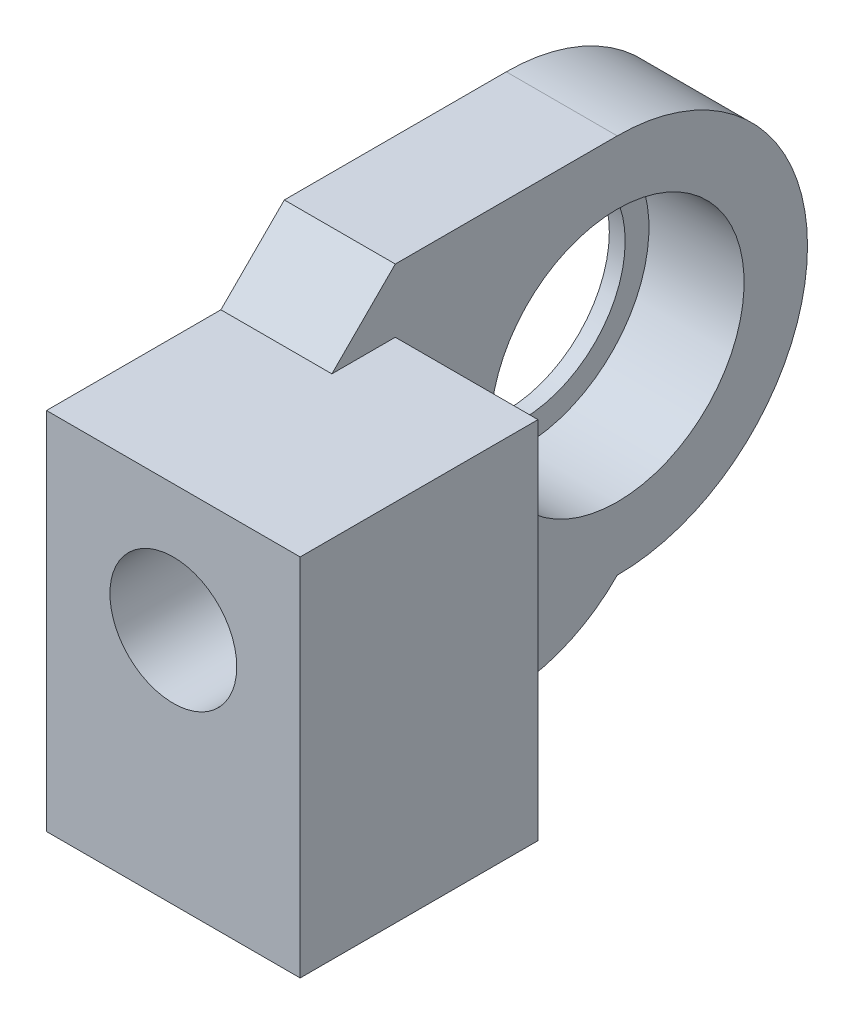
ISO-10303-21;
HEADER;
FILE_DESCRIPTION(('STEP AP214'),'2;1');
FILE_NAME('part.step','',(''),(''),'','','');
FILE_SCHEMA(('AUTOMOTIVE_DESIGN { 1 0 10303 214 1 1 1 1 }'));
ENDSEC;
DATA;
#1=APPLICATION_CONTEXT('core data for automotive mechanical design processes');
#2=APPLICATION_PROTOCOL_DEFINITION('international standard','automotive_design',2000,#1);
#3=PRODUCT_CONTEXT('',#1,'mechanical');
#4=PRODUCT('Part','Part','',(#3));
#5=PRODUCT_RELATED_PRODUCT_CATEGORY('part','',(#4));
#6=PRODUCT_DEFINITION_FORMATION('','',#4);
#7=PRODUCT_DEFINITION_CONTEXT('part definition',#1,'design');
#8=PRODUCT_DEFINITION('design','',#6,#7);
#9=PRODUCT_DEFINITION_SHAPE('','',#8);
#10=(LENGTH_UNIT() NAMED_UNIT(*) SI_UNIT(.MILLI.,.METRE.));
#11=(NAMED_UNIT(*) PLANE_ANGLE_UNIT() SI_UNIT($,.RADIAN.));
#12=(NAMED_UNIT(*) SI_UNIT($,.STERADIAN.) SOLID_ANGLE_UNIT());
#13=UNCERTAINTY_MEASURE_WITH_UNIT(LENGTH_MEASURE(1.E-05),#10,'distance_accuracy_value','');
#14=(GEOMETRIC_REPRESENTATION_CONTEXT(3) GLOBAL_UNCERTAINTY_ASSIGNED_CONTEXT((#13)) GLOBAL_UNIT_ASSIGNED_CONTEXT((#10,
#11,#12)) REPRESENTATION_CONTEXT('',''));
#15=CARTESIAN_POINT('',(0.,0.,0.));
#16=DIRECTION('',(0.,0.,1.));
#17=DIRECTION('',(1.,0.,0.));
#18=AXIS2_PLACEMENT_3D('',#15,#16,#17);
#19=CARTESIAN_POINT('',(0.,0.,10.));
#20=DIRECTION('',(0.,0.,-1.));
#21=DIRECTION('',(-1.,0.,0.));
#22=AXIS2_PLACEMENT_3D('',#19,#20,#21);
#23=PLANE('',#22);
#24=DIRECTION('',(0.,1.,0.));
#25=VECTOR('',#24,1.);
#26=CARTESIAN_POINT('',(8.,8.,10.));
#27=LINE('',#26,#25);
#28=CARTESIAN_POINT('',(8.,-15.,10.));
#29=VERTEX_POINT('',#28);
#30=CARTESIAN_POINT('',(8.,8.,10.));
#31=VERTEX_POINT('',#30);
#32=EDGE_CURVE('E163',#29,#31,#27,.T.);
#33=ORIENTED_EDGE('',*,*,#32,.T.);
#34=DIRECTION('',(-1.,0.,0.));
#35=VECTOR('',#34,1.);
#36=CARTESIAN_POINT('',(8.,8.,10.));
#37=LINE('',#36,#35);
#38=CARTESIAN_POINT('',(-8.,8.,10.));
#39=VERTEX_POINT('',#38);
#40=EDGE_CURVE('E170',#31,#39,#37,.T.);
#41=ORIENTED_EDGE('',*,*,#40,.T.);
#42=DIRECTION('',(0.,-1.,0.));
#43=VECTOR('',#42,1.);
#44=CARTESIAN_POINT('',(-8.,8.,10.));
#45=LINE('',#44,#43);
#46=CARTESIAN_POINT('',(-8.,-15.,10.));
#47=VERTEX_POINT('',#46);
#48=EDGE_CURVE('E173',#39,#47,#45,.T.);
#49=ORIENTED_EDGE('',*,*,#48,.T.);
#50=DIRECTION('',(1.,0.,0.));
#51=VECTOR('',#50,1.);
#52=CARTESIAN_POINT('',(8.,-15.,10.));
#53=LINE('',#52,#51);
#54=EDGE_CURVE('E176',#47,#29,#53,.T.);
#55=ORIENTED_EDGE('',*,*,#54,.T.);
#56=EDGE_LOOP('',(#33,#41,#49,#55));
#57=FACE_BOUND('',#56,.T.);
#58=CARTESIAN_POINT('',(0.,0.,10.));
#59=DIRECTION('',(0.,0.,1.));
#60=DIRECTION('',(1.,0.,0.));
#61=AXIS2_PLACEMENT_3D('',#58,#59,#60);
#62=CIRCLE('',#61,4.);
#63=CARTESIAN_POINT('',(4.,0.,10.));
#64=VERTEX_POINT('',#63);
#65=EDGE_CURVE('E159',#64,#64,#62,.T.);
#66=ORIENTED_EDGE('',*,*,#65,.F.);
#67=EDGE_LOOP('',(#66));
#68=FACE_BOUND('',#67,.T.);
#69=ADVANCED_FACE('F41',(#57,#68),#23,.F.);
#70=CARTESIAN_POINT('',(8.,8.,10.));
#71=DIRECTION('',(-1.,0.,0.));
#72=DIRECTION('',(0.,-1.,0.));
#73=AXIS2_PLACEMENT_3D('',#70,#71,#72);
#74=PLANE('',#73);
#75=DIRECTION('',(0.,0.,-1.));
#76=VECTOR('',#75,1.);
#77=CARTESIAN_POINT('',(8.,-15.,10.));
#78=LINE('',#77,#76);
#79=CARTESIAN_POINT('',(8.,-15.,-5.));
#80=VERTEX_POINT('',#79);
#81=EDGE_CURVE('E179',#29,#80,#78,.T.);
#82=ORIENTED_EDGE('',*,*,#81,.T.);
#83=DIRECTION('',(0.,-1.,0.));
#84=VECTOR('',#83,1.);
#85=CARTESIAN_POINT('',(8.,8.,-5.));
#86=LINE('',#85,#84);
#87=CARTESIAN_POINT('',(8.,8.,-5.));
#88=VERTEX_POINT('',#87);
#89=EDGE_CURVE('E146',#88,#80,#86,.T.);
#90=ORIENTED_EDGE('',*,*,#89,.F.);
#91=DIRECTION('',(0.,0.,-1.));
#92=VECTOR('',#91,1.);
#93=CARTESIAN_POINT('',(8.,8.,10.));
#94=LINE('',#93,#92);
#95=EDGE_CURVE('E190',#31,#88,#94,.T.);
#96=ORIENTED_EDGE('',*,*,#95,.F.);
#97=ORIENTED_EDGE('',*,*,#32,.F.);
#98=EDGE_LOOP('',(#82,#90,#96,#97));
#99=FACE_BOUND('',#98,.T.);
#100=ADVANCED_FACE('F256',(#99),#74,.F.);
#101=CARTESIAN_POINT('',(8.,8.,10.));
#102=DIRECTION('',(0.,-1.,0.));
#103=DIRECTION('',(0.,0.,-1.));
#104=AXIS2_PLACEMENT_3D('',#101,#102,#103);
#105=PLANE('',#104);
#106=DIRECTION('',(1.,0.,0.));
#107=VECTOR('',#106,1.);
#108=CARTESIAN_POINT('',(-8.,8.,-5.));
#109=LINE('',#108,#107);
#110=CARTESIAN_POINT('',(-0.999999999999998,8.,-5.));
#111=VERTEX_POINT('',#110);
#112=EDGE_CURVE('E142',#111,#88,#109,.T.);
#113=ORIENTED_EDGE('',*,*,#112,.F.);
#114=DIRECTION('',(0.,0.,1.));
#115=VECTOR('',#114,1.);
#116=CARTESIAN_POINT('',(-1.,8.,-19.));
#117=LINE('',#116,#115);
#118=CARTESIAN_POINT('',(-1.,8.,-0.99999999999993));
#119=VERTEX_POINT('',#118);
#120=EDGE_CURVE('E58',#111,#119,#117,.T.);
#121=ORIENTED_EDGE('',*,*,#120,.T.);
#122=DIRECTION('',(-1.,0.,0.));
#123=VECTOR('',#122,1.);
#124=CARTESIAN_POINT('',(-8.,8.,-0.99999999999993));
#125=LINE('',#124,#123);
#126=CARTESIAN_POINT('',(-8.,8.,-0.99999999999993));
#127=VERTEX_POINT('',#126);
#128=EDGE_CURVE('E203',#119,#127,#125,.T.);
#129=ORIENTED_EDGE('',*,*,#128,.T.);
#130=DIRECTION('',(0.,0.,-1.));
#131=VECTOR('',#130,1.);
#132=CARTESIAN_POINT('',(-8.,8.,10.));
#133=LINE('',#132,#131);
#134=EDGE_CURVE('E186',#39,#127,#133,.T.);
#135=ORIENTED_EDGE('',*,*,#134,.F.);
#136=ORIENTED_EDGE('',*,*,#40,.F.);
#137=ORIENTED_EDGE('',*,*,#95,.T.);
#138=EDGE_LOOP('',(#113,#121,#129,#135,#136,#137));
#139=FACE_BOUND('',#138,.T.);
#140=ADVANCED_FACE('F221',(#139),#105,.F.);
#141=CARTESIAN_POINT('',(-8.,8.,10.));
#142=DIRECTION('',(1.,0.,0.));
#143=DIRECTION('',(0.,1.,0.));
#144=AXIS2_PLACEMENT_3D('',#141,#142,#143);
#145=PLANE('',#144);
#146=CARTESIAN_POINT('',(-8.,0.,-19.));
#147=DIRECTION('',(1.,0.,0.));
#148=DIRECTION('',(0.,-1.,0.));
#149=AXIS2_PLACEMENT_3D('',#146,#147,#148);
#150=CIRCLE('',#149,12.);
#151=CARTESIAN_POINT('',(-8.,-12.,-19.));
#152=VERTEX_POINT('',#151);
#153=CARTESIAN_POINT('',(-8.,12.,-19.));
#154=VERTEX_POINT('',#153);
#155=EDGE_CURVE('E140',#152,#154,#150,.T.);
#156=ORIENTED_EDGE('',*,*,#155,.F.);
#157=CARTESIAN_POINT('',(-8.,-5.,-11.8585715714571));
#158=DIRECTION('',(1.,0.,0.));
#159=DIRECTION('',(0.,1.,0.));
#160=AXIS2_PLACEMENT_3D('',#157,#158,#159);
#161=CIRCLE('',#160,10.);
#162=CARTESIAN_POINT('',(-8.,-15.,-11.8585715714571));
#163=VERTEX_POINT('',#162);
#164=EDGE_CURVE('E195',#152,#163,#161,.F.);
#165=ORIENTED_EDGE('',*,*,#164,.T.);
#166=DIRECTION('',(0.,0.,-1.));
#167=VECTOR('',#166,1.);
#168=CARTESIAN_POINT('',(-8.,-15.,10.));
#169=LINE('',#168,#167);
#170=EDGE_CURVE('E182',#47,#163,#169,.T.);
#171=ORIENTED_EDGE('',*,*,#170,.F.);
#172=ORIENTED_EDGE('',*,*,#48,.F.);
#173=ORIENTED_EDGE('',*,*,#134,.T.);
#174=DIRECTION('',(0.,-0.707106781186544,0.707106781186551));
#175=VECTOR('',#174,1.);
#176=CARTESIAN_POINT('',(-8.,2.50000000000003,4.50000000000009));
#177=LINE('',#176,#175);
#178=CARTESIAN_POINT('',(-8.,12.,-5.));
#179=VERTEX_POINT('',#178);
#180=EDGE_CURVE('E51',#127,#179,#177,.F.);
#181=ORIENTED_EDGE('',*,*,#180,.T.);
#182=DIRECTION('',(0.,0.,1.));
#183=VECTOR('',#182,1.);
#184=CARTESIAN_POINT('',(-8.,12.,-5.));
#185=LINE('',#184,#183);
#186=EDGE_CURVE('E136',#154,#179,#185,.T.);
#187=ORIENTED_EDGE('',*,*,#186,.F.);
#188=EDGE_LOOP('',(#156,#165,#171,#172,#173,#181,#187));
#189=FACE_BOUND('',#188,.T.);
#190=CARTESIAN_POINT('',(-8.,0.,-19.));
#191=DIRECTION('',(1.,0.,0.));
#192=DIRECTION('',(0.,1.,0.));
#193=AXIS2_PLACEMENT_3D('',#190,#191,#192);
#194=CIRCLE('',#193,6.50000000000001);
#195=CARTESIAN_POINT('',(-8.,6.5,-19.));
#196=VERTEX_POINT('',#195);
#197=EDGE_CURVE('E357',#196,#196,#194,.T.);
#198=ORIENTED_EDGE('',*,*,#197,.T.);
#199=EDGE_LOOP('',(#198));
#200=FACE_BOUND('',#199,.T.);
#201=ADVANCED_FACE('F212',(#189,#200),#145,.F.);
#202=CARTESIAN_POINT('',(8.,-15.,10.));
#203=DIRECTION('',(0.,1.,0.));
#204=DIRECTION('',(0.,0.,1.));
#205=AXIS2_PLACEMENT_3D('',#202,#203,#204);
#206=PLANE('',#205);
#207=ORIENTED_EDGE('',*,*,#170,.T.);
#208=DIRECTION('',(-1.,0.,0.));
#209=VECTOR('',#208,1.);
#210=CARTESIAN_POINT('',(8.,-15.,-11.8585715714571));
#211=LINE('',#210,#209);
#212=CARTESIAN_POINT('',(-0.999999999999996,-15.,-11.8585715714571));
#213=VERTEX_POINT('',#212);
#214=EDGE_CURVE('E198',#163,#213,#211,.F.);
#215=ORIENTED_EDGE('',*,*,#214,.T.);
#216=DIRECTION('',(0.,0.,-1.));
#217=VECTOR('',#216,1.);
#218=CARTESIAN_POINT('',(-0.999999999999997,-15.,-19.));
#219=LINE('',#218,#217);
#220=CARTESIAN_POINT('',(-0.999999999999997,-15.,-5.));
#221=VERTEX_POINT('',#220);
#222=EDGE_CURVE('E123',#221,#213,#219,.T.);
#223=ORIENTED_EDGE('',*,*,#222,.F.);
#224=DIRECTION('',(-1.,0.,0.));
#225=VECTOR('',#224,1.);
#226=CARTESIAN_POINT('',(8.,-15.,-5.));
#227=LINE('',#226,#225);
#228=EDGE_CURVE('E155',#80,#221,#227,.T.);
#229=ORIENTED_EDGE('',*,*,#228,.F.);
#230=ORIENTED_EDGE('',*,*,#81,.F.);
#231=ORIENTED_EDGE('',*,*,#54,.F.);
#232=EDGE_LOOP('',(#207,#215,#223,#229,#230,#231));
#233=FACE_BOUND('',#232,.T.);
#234=ADVANCED_FACE('F242',(#233),#206,.F.);
#235=CARTESIAN_POINT('',(0.,0.,10.));
#236=DIRECTION('',(0.,0.,-1.));
#237=DIRECTION('',(-1.,0.,0.));
#238=AXIS2_PLACEMENT_3D('',#235,#236,#237);
#239=CYLINDRICAL_SURFACE('',#238,4.);
#240=ORIENTED_EDGE('',*,*,#65,.T.);
#241=EDGE_LOOP('',(#240));
#242=FACE_BOUND('',#241,.T.);
#243=CARTESIAN_POINT('',(0.,0.,0.));
#244=DIRECTION('',(0.,0.,1.));
#245=DIRECTION('',(1.,0.,0.));
#246=AXIS2_PLACEMENT_3D('',#243,#244,#245);
#247=CIRCLE('',#246,4.);
#248=CARTESIAN_POINT('',(4.,0.,0.));
#249=VERTEX_POINT('',#248);
#250=EDGE_CURVE('E158',#249,#249,#247,.T.);
#251=ORIENTED_EDGE('',*,*,#250,.F.);
#252=EDGE_LOOP('',(#251));
#253=FACE_BOUND('',#252,.T.);
#254=ADVANCED_FACE('F266',(#242,#253),#239,.F.);
#255=CARTESIAN_POINT('',(0.,0.,0.));
#256=DIRECTION('',(0.,0.,-1.));
#257=DIRECTION('',(-1.,0.,0.));
#258=AXIS2_PLACEMENT_3D('',#255,#256,#257);
#259=PLANE('',#258);
#260=ORIENTED_EDGE('',*,*,#250,.T.);
#261=EDGE_LOOP('',(#260));
#262=FACE_BOUND('',#261,.T.);
#263=ADVANCED_FACE('F296',(#262),#259,.F.);
#264=CARTESIAN_POINT('',(0.,0.,-5.));
#265=DIRECTION('',(0.,0.,-1.));
#266=DIRECTION('',(-1.,0.,0.));
#267=AXIS2_PLACEMENT_3D('',#264,#265,#266);
#268=PLANE('',#267);
#269=DIRECTION('',(0.,-1.,0.));
#270=VECTOR('',#269,1.);
#271=CARTESIAN_POINT('',(-0.999999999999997,-15.,-5.));
#272=LINE('',#271,#270);
#273=EDGE_CURVE('E194',#111,#221,#272,.T.);
#274=ORIENTED_EDGE('',*,*,#273,.F.);
#275=ORIENTED_EDGE('',*,*,#112,.T.);
#276=ORIENTED_EDGE('',*,*,#89,.T.);
#277=ORIENTED_EDGE('',*,*,#228,.T.);
#278=EDGE_LOOP('',(#274,#275,#276,#277));
#279=FACE_BOUND('',#278,.T.);
#280=ADVANCED_FACE('F226',(#279),#268,.T.);
#281=CARTESIAN_POINT('',(-0.999999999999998,0.,-19.));
#282=DIRECTION('',(-1.,0.,0.));
#283=DIRECTION('',(0.,-1.,0.));
#284=AXIS2_PLACEMENT_3D('',#281,#282,#283);
#285=PLANE('',#284);
#286=ORIENTED_EDGE('',*,*,#222,.T.);
#287=CARTESIAN_POINT('',(-0.999999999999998,-5.,-11.8585715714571));
#288=DIRECTION('',(-1.,0.,0.));
#289=DIRECTION('',(0.,-1.,0.));
#290=AXIS2_PLACEMENT_3D('',#287,#288,#289);
#291=CIRCLE('',#290,10.);
#292=CARTESIAN_POINT('',(-0.999999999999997,-12.,-19.));
#293=VERTEX_POINT('',#292);
#294=EDGE_CURVE('E131',#213,#293,#291,.F.);
#295=ORIENTED_EDGE('',*,*,#294,.T.);
#296=CARTESIAN_POINT('',(-0.999999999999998,0.,-19.));
#297=DIRECTION('',(1.,0.,0.));
#298=DIRECTION('',(0.,-1.,0.));
#299=AXIS2_PLACEMENT_3D('',#296,#297,#298);
#300=CIRCLE('',#299,12.);
#301=CARTESIAN_POINT('',(-1.,12.,-19.));
#302=VERTEX_POINT('',#301);
#303=EDGE_CURVE('E124',#293,#302,#300,.T.);
#304=ORIENTED_EDGE('',*,*,#303,.T.);
#305=DIRECTION('',(0.,0.,1.));
#306=VECTOR('',#305,1.);
#307=CARTESIAN_POINT('',(-1.,12.,-5.));
#308=LINE('',#307,#306);
#309=CARTESIAN_POINT('',(-1.,12.,-5.));
#310=VERTEX_POINT('',#309);
#311=EDGE_CURVE('E113',#302,#310,#308,.T.);
#312=ORIENTED_EDGE('',*,*,#311,.T.);
#313=DIRECTION('',(0.,0.707106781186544,-0.707106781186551));
#314=VECTOR('',#313,1.);
#315=CARTESIAN_POINT('',(-1.,13.0000000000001,-6.00000000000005));
#316=LINE('',#315,#314);
#317=EDGE_CURVE('E63',#310,#119,#316,.F.);
#318=ORIENTED_EDGE('',*,*,#317,.T.);
#319=ORIENTED_EDGE('',*,*,#120,.F.);
#320=ORIENTED_EDGE('',*,*,#273,.T.);
#321=EDGE_LOOP('',(#286,#295,#304,#312,#318,#319,#320));
#322=FACE_BOUND('',#321,.T.);
#323=CARTESIAN_POINT('',(-0.999999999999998,0.,-19.));
#324=DIRECTION('',(1.,0.,0.));
#325=DIRECTION('',(0.,1.,0.));
#326=AXIS2_PLACEMENT_3D('',#323,#324,#325);
#327=CIRCLE('',#326,8.);
#328=CARTESIAN_POINT('',(-1.,8.,-19.));
#329=VERTEX_POINT('',#328);
#330=EDGE_CURVE('E235',#329,#329,#327,.T.);
#331=ORIENTED_EDGE('',*,*,#330,.F.);
#332=EDGE_LOOP('',(#331));
#333=FACE_BOUND('',#332,.T.);
#334=ADVANCED_FACE('F128',(#322,#333),#285,.F.);
#335=CARTESIAN_POINT('',(-0.999999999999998,0.,-19.));
#336=DIRECTION('',(-1.,0.,0.));
#337=DIRECTION('',(0.,-1.,0.));
#338=AXIS2_PLACEMENT_3D('',#335,#336,#337);
#339=CYLINDRICAL_SURFACE('',#338,12.);
#340=ORIENTED_EDGE('',*,*,#155,.T.);
#341=DIRECTION('',(-1.,0.,0.));
#342=VECTOR('',#341,1.);
#343=CARTESIAN_POINT('',(-1.,12.,-19.));
#344=LINE('',#343,#342);
#345=EDGE_CURVE('E118',#302,#154,#344,.T.);
#346=ORIENTED_EDGE('',*,*,#345,.F.);
#347=ORIENTED_EDGE('',*,*,#303,.F.);
#348=DIRECTION('',(-1.,0.,0.));
#349=VECTOR('',#348,1.);
#350=CARTESIAN_POINT('',(-0.999999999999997,-12.,-19.));
#351=LINE('',#350,#349);
#352=EDGE_CURVE('E148',#293,#152,#351,.T.);
#353=ORIENTED_EDGE('',*,*,#352,.T.);
#354=EDGE_LOOP('',(#340,#346,#347,#353));
#355=FACE_BOUND('',#354,.T.);
#356=ADVANCED_FACE('F138',(#355),#339,.T.);
#357=CARTESIAN_POINT('',(-1.,12.,-5.));
#358=DIRECTION('',(0.,-1.,0.));
#359=DIRECTION('',(1.,0.,0.));
#360=AXIS2_PLACEMENT_3D('',#357,#358,#359);
#361=PLANE('',#360);
#362=ORIENTED_EDGE('',*,*,#186,.T.);
#363=DIRECTION('',(-1.,0.,0.));
#364=VECTOR('',#363,1.);
#365=CARTESIAN_POINT('',(-1.,12.,-5.));
#366=LINE('',#365,#364);
#367=EDGE_CURVE('E121',#310,#179,#366,.T.);
#368=ORIENTED_EDGE('',*,*,#367,.F.);
#369=ORIENTED_EDGE('',*,*,#311,.F.);
#370=ORIENTED_EDGE('',*,*,#345,.T.);
#371=EDGE_LOOP('',(#362,#368,#369,#370));
#372=FACE_BOUND('',#371,.T.);
#373=ADVANCED_FACE('F116',(#372),#361,.F.);
#374=CARTESIAN_POINT('',(-0.999999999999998,0.,-19.));
#375=DIRECTION('',(-1.,0.,0.));
#376=DIRECTION('',(0.,-1.,0.));
#377=AXIS2_PLACEMENT_3D('',#374,#375,#376);
#378=CYLINDRICAL_SURFACE('',#377,8.);
#379=CARTESIAN_POINT('',(-7.,0.,-19.));
#380=DIRECTION('',(1.,0.,0.));
#381=DIRECTION('',(0.,1.,0.));
#382=AXIS2_PLACEMENT_3D('',#379,#380,#381);
#383=CIRCLE('',#382,8.);
#384=CARTESIAN_POINT('',(-7.,8.,-19.));
#385=VERTEX_POINT('',#384);
#386=EDGE_CURVE('E11',#385,#385,#383,.T.);
#387=ORIENTED_EDGE('',*,*,#386,.F.);
#388=EDGE_LOOP('',(#387));
#389=FACE_BOUND('',#388,.T.);
#390=ORIENTED_EDGE('',*,*,#330,.T.);
#391=EDGE_LOOP('',(#390));
#392=FACE_BOUND('',#391,.T.);
#393=ADVANCED_FACE('F246',(#389,#392),#378,.F.);
#394=CARTESIAN_POINT('',(-0.999999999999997,-5.,-11.8585715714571));
#395=DIRECTION('',(-1.,0.,0.));
#396=DIRECTION('',(0.,-1.,0.));
#397=AXIS2_PLACEMENT_3D('',#394,#395,#396);
#398=CYLINDRICAL_SURFACE('',#397,10.);
#399=ORIENTED_EDGE('',*,*,#294,.F.);
#400=ORIENTED_EDGE('',*,*,#214,.F.);
#401=ORIENTED_EDGE('',*,*,#164,.F.);
#402=ORIENTED_EDGE('',*,*,#352,.F.);
#403=EDGE_LOOP('',(#399,#400,#401,#402));
#404=FACE_BOUND('',#403,.T.);
#405=ADVANCED_FACE('F244',(#404),#398,.T.);
#406=CARTESIAN_POINT('',(-0.999999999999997,12.,-5.));
#407=DIRECTION('',(0.,0.707106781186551,0.707106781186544));
#408=DIRECTION('',(-1.,0.,0.));
#409=AXIS2_PLACEMENT_3D('',#406,#407,#408);
#410=PLANE('',#409);
#411=ORIENTED_EDGE('',*,*,#180,.F.);
#412=ORIENTED_EDGE('',*,*,#128,.F.);
#413=ORIENTED_EDGE('',*,*,#317,.F.);
#414=ORIENTED_EDGE('',*,*,#367,.T.);
#415=EDGE_LOOP('',(#411,#412,#413,#414));
#416=FACE_BOUND('',#415,.T.);
#417=ADVANCED_FACE('F44',(#416),#410,.T.);
#418=CARTESIAN_POINT('',(-7.,0.,-19.));
#419=DIRECTION('',(1.,0.,0.));
#420=DIRECTION('',(0.,1.,0.));
#421=AXIS2_PLACEMENT_3D('',#418,#419,#420);
#422=PLANE('',#421);
#423=ORIENTED_EDGE('',*,*,#386,.T.);
#424=EDGE_LOOP('',(#423));
#425=FACE_BOUND('',#424,.T.);
#426=CARTESIAN_POINT('',(-7.,0.,-19.));
#427=DIRECTION('',(1.,0.,0.));
#428=DIRECTION('',(0.,1.,0.));
#429=AXIS2_PLACEMENT_3D('',#426,#427,#428);
#430=CIRCLE('',#429,6.50000000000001);
#431=CARTESIAN_POINT('',(-7.,6.5,-19.));
#432=VERTEX_POINT('',#431);
#433=EDGE_CURVE('E354',#432,#432,#430,.T.);
#434=ORIENTED_EDGE('',*,*,#433,.F.);
#435=EDGE_LOOP('',(#434));
#436=FACE_BOUND('',#435,.T.);
#437=ADVANCED_FACE('F251',(#425,#436),#422,.T.);
#438=CARTESIAN_POINT('',(-7.,0.,-19.));
#439=DIRECTION('',(-1.,0.,0.));
#440=DIRECTION('',(0.,-1.,0.));
#441=AXIS2_PLACEMENT_3D('',#438,#439,#440);
#442=CYLINDRICAL_SURFACE('',#441,6.50000000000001);
#443=ORIENTED_EDGE('',*,*,#433,.T.);
#444=EDGE_LOOP('',(#443));
#445=FACE_BOUND('',#444,.T.);
#446=ORIENTED_EDGE('',*,*,#197,.F.);
#447=EDGE_LOOP('',(#446));
#448=FACE_BOUND('',#447,.T.);
#449=ADVANCED_FACE('F337',(#445,#448),#442,.F.);
#450=CLOSED_SHELL('',(#69,#100,#140,#201,#234,#254,#263,#280,#334,#356,#373,#393,#405,#417,#437,#449));
#451=MANIFOLD_SOLID_BREP('B2',#450);
#452=ADVANCED_BREP_SHAPE_REPRESENTATION('',(#18,#451),#14);
#453=SHAPE_DEFINITION_REPRESENTATION(#9,#452);
ENDSEC;
END-ISO-10303-21;
